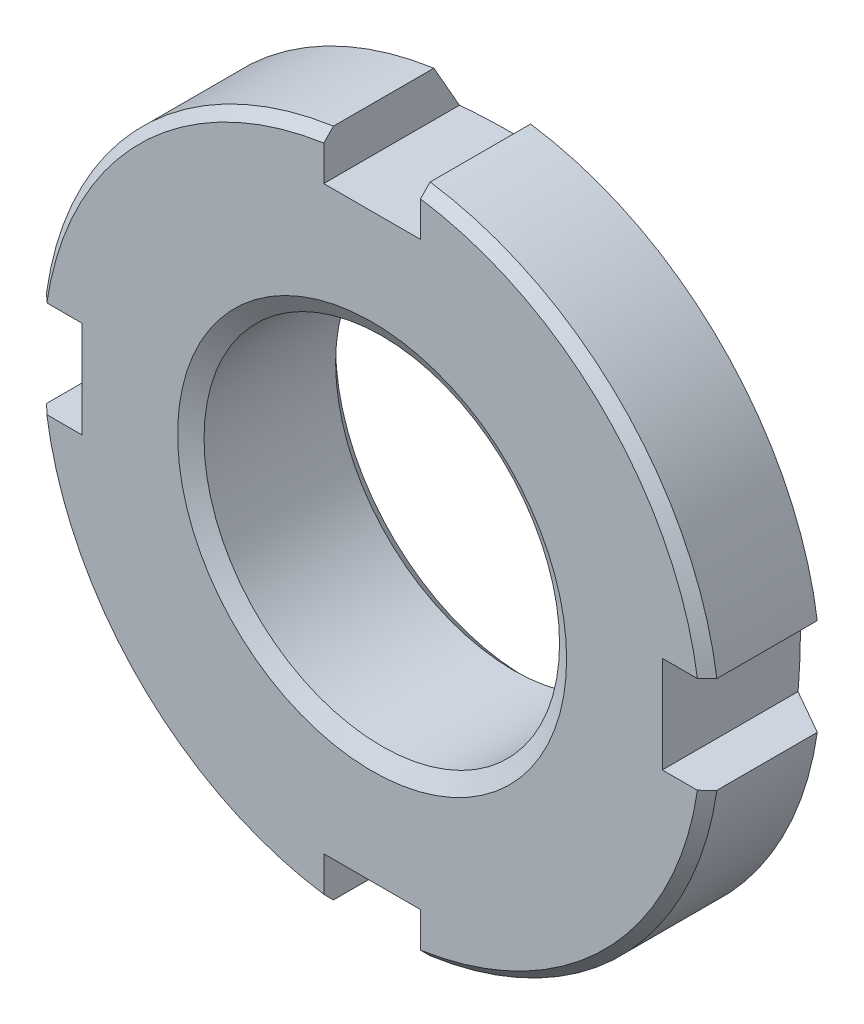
from build123d import *

# Parameters (mm, degrees)
SKETCH1_R        = 17.5
SKETCH1_R_2      = 9.188
BASENUT_DEPTH    = 8
CHAMFER1_SIZE    = 0.5
ENDCHAMFER_SIZE  = 0.866025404
ENDCHAMFER_SIZE2 = 0.5
CHAMFER2_SIZE    = 0.7
SLOTCUT_DEPTH    = 32.227937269
SLOTPAT_COUNT    = 4


with BuildPart() as part:
    # Sketch1 → BaseNut (new body)
    with BuildSketch(Plane.XY):
        Circle(SKETCH1_R)
        Circle(SKETCH1_R_2, mode=Mode.SUBTRACT)
    extrude(amount=-BASENUT_DEPTH)

    # Sketch2 → StepCut (revolve, cut)
    with BuildSketch(Plane(origin=(0, 0, 0), x_dir=(1, 0, 0), z_dir=(0, 1, 0)), mode=Mode.PRIVATE) as stepcut_sk:
        Polygon((-17.5, 8), (-13.5, 8), (-17.5, 5.690598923), align=None)
    revolve(stepcut_sk.sketch.rotate(Axis((0, 0, -4.560481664), (0, 0, 1)), 180), axis=Axis((0, 0, -4.560481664), (0, 0, 1)), mode=Mode.SUBTRACT)

    # Chamfer1
    chamfer1_edges = [part.edges().sort_by_distance(p)[0] for p in [
        (-17.5, 0, 0),
    ]]
    chamfer(chamfer1_edges, length=CHAMFER1_SIZE)

    # EndChamfer
    endchamfer_edges = [part.edges().sort_by_distance(p)[0] for p in [
        (-9.188, 0, 0),
    ]]
    endchamfer_side = [part.faces().sort_by_distance(p)[0] for p in [
        (-16.519167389, 0, 0),
    ]]
    chamfer(endchamfer_edges, length=ENDCHAMFER_SIZE, length2=ENDCHAMFER_SIZE2, reference=endchamfer_side[0])

    # Chamfer2
    chamfer2_edges = [part.edges().sort_by_distance(p)[0] for p in [
        (-9.188, 0, -8),
    ]]
    chamfer(chamfer2_edges, length=CHAMFER2_SIZE)

    # Sketch3 → SlotCut (cut, through all)
    with BuildSketch(Plane(origin=(-3.554280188, 4.131027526, -8), x_dir=(-1, 0, 0), z_dir=(0, 0, -1))):
        with BuildLine():
            Line((-6.054280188, -19.131027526), (-1.054280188, -19.131027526))
            Line((-1.054280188, -19.131027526), (-1.054280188, -21.451535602))
            ThreePointArc((-1.054280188, -21.451535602), (-3.554280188, -21.631027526), (-6.054280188, -21.451535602))
            Line((-6.054280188, -21.451535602), (-6.054280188, -19.131027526))
        make_face()
    slotcut = extrude(amount=-SLOTCUT_DEPTH, mode=Mode.SUBTRACT)

    # SlotPat: SlotCut ×4 about axis
    slotpat_axis = Axis((0, 0, -4.560481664), (0, 0, 1))
    for i in range(1, SLOTPAT_COUNT):
        add(slotcut.rotate(slotpat_axis, i * 360 / SLOTPAT_COUNT), mode=Mode.SUBTRACT)


solid = part.part
